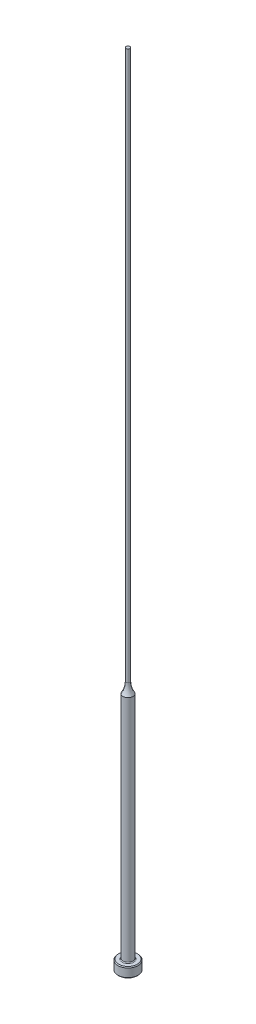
from build123d import *

# Parameters (mm, degrees)
CHAMFER1_SIZE = 0.254
FILLET1_R     = 0.254


with BuildPart() as part:
    # Sketch1 → Revolve1 (revolve)
    with BuildSketch(Plane.XY, mode=Mode.PRIVATE) as revolve1_sk:
        with BuildLine():
            Line((0, 0), (-3.175, 0))
            Line((-3.175, 0), (-3.175, 3.175))
            Line((-3.175, 3.175), (-1.5875, 3.175))
            Line((-1.5875, 3.175), (-1.5875, 76.2))
            ThreePointArc((-1.5875, 76.2), (-0.847698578, 77.834042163), (-0.59436, 79.609772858))
            Line((-0.59436, 79.609772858), (-0.59436, 254))
            Line((-0.59436, 254), (0, 254))
            Line((0, 254), (0, 0))
        make_face()
    revolve(revolve1_sk.sketch.rotate(Axis((0, 259.958771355, 0), (0, -1, 0)), 270), axis=Axis((0, 259.958771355, 0), (0, -1, 0)))

    # Chamfer1
    chamfer1_edges = [part.edges().sort_by_distance(p)[0] for p in [
        (0, 0, -3.175),
        (0, 3.175, -3.175),
    ]]
    chamfer(chamfer1_edges, length=CHAMFER1_SIZE)

    # Fillet1
    fillet1_edges = [part.edges().sort_by_distance(p)[0] for p in [
        (0, 3.175, -1.5875),
    ]]
    fillet(fillet1_edges, radius=FILLET1_R)


solid = part.part
